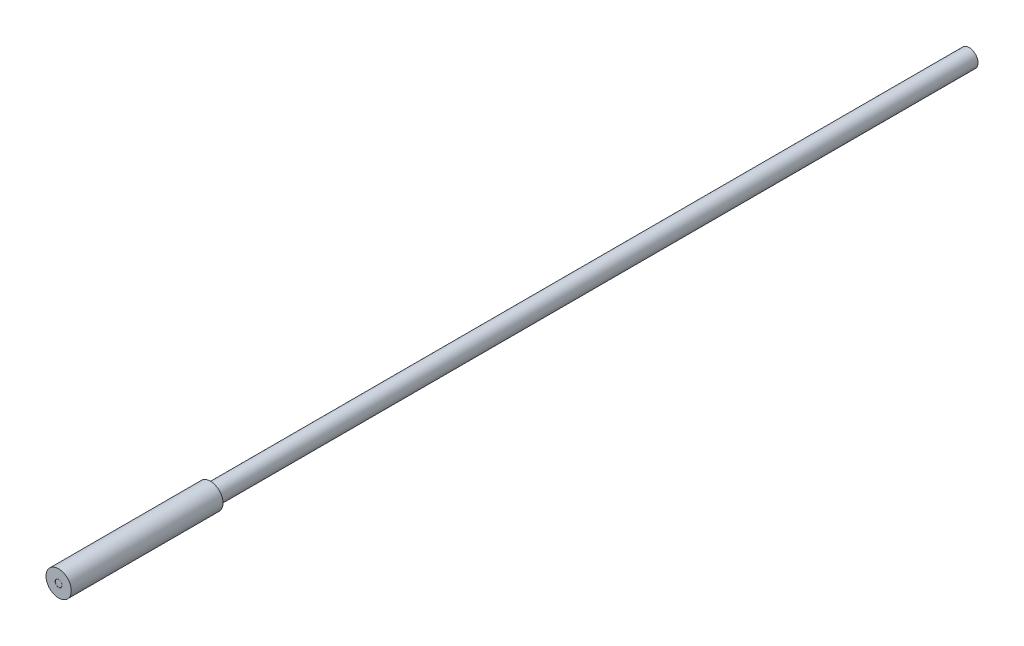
ISO-10303-21;
HEADER;
FILE_DESCRIPTION(('STEP AP214'),'2;1');
FILE_NAME('part.step','',(''),(''),'','','');
FILE_SCHEMA(('AUTOMOTIVE_DESIGN { 1 0 10303 214 1 1 1 1 }'));
ENDSEC;
DATA;
#1=APPLICATION_CONTEXT('core data for automotive mechanical design processes');
#2=APPLICATION_PROTOCOL_DEFINITION('international standard','automotive_design',2000,#1);
#3=PRODUCT_CONTEXT('',#1,'mechanical');
#4=PRODUCT('Part','Part','',(#3));
#5=PRODUCT_RELATED_PRODUCT_CATEGORY('part','',(#4));
#6=PRODUCT_DEFINITION_FORMATION('','',#4);
#7=PRODUCT_DEFINITION_CONTEXT('part definition',#1,'design');
#8=PRODUCT_DEFINITION('design','',#6,#7);
#9=PRODUCT_DEFINITION_SHAPE('','',#8);
#10=(LENGTH_UNIT() NAMED_UNIT(*) SI_UNIT(.MILLI.,.METRE.));
#11=(NAMED_UNIT(*) PLANE_ANGLE_UNIT() SI_UNIT($,.RADIAN.));
#12=(NAMED_UNIT(*) SI_UNIT($,.STERADIAN.) SOLID_ANGLE_UNIT());
#13=UNCERTAINTY_MEASURE_WITH_UNIT(LENGTH_MEASURE(1.E-05),#10,'distance_accuracy_value','');
#14=(GEOMETRIC_REPRESENTATION_CONTEXT(3) GLOBAL_UNCERTAINTY_ASSIGNED_CONTEXT((#13)) GLOBAL_UNIT_ASSIGNED_CONTEXT((#10,
#11,#12)) REPRESENTATION_CONTEXT('',''));
#15=CARTESIAN_POINT('',(0.,0.,0.));
#16=DIRECTION('',(0.,0.,1.));
#17=DIRECTION('',(1.,0.,0.));
#18=AXIS2_PLACEMENT_3D('',#15,#16,#17);
#19=CARTESIAN_POINT('',(0.,0.,-6.));
#20=DIRECTION('',(0.,0.,1.));
#21=DIRECTION('',(1.,0.,0.));
#22=AXIS2_PLACEMENT_3D('',#19,#20,#21);
#23=CYLINDRICAL_SURFACE('',#22,0.5);
#24=CARTESIAN_POINT('',(0.,0.,-6.));
#25=DIRECTION('',(0.,0.,1.));
#26=DIRECTION('',(1.,0.,0.));
#27=AXIS2_PLACEMENT_3D('',#24,#25,#26);
#28=CIRCLE('',#27,0.5);
#29=CARTESIAN_POINT('',(0.5,0.,-6.));
#30=VERTEX_POINT('',#29);
#31=EDGE_CURVE('E41',#30,#30,#28,.T.);
#32=ORIENTED_EDGE('',*,*,#31,.T.);
#33=EDGE_LOOP('',(#32));
#34=FACE_BOUND('',#33,.T.);
#35=CARTESIAN_POINT('',(0.,0.,0.));
#36=DIRECTION('',(0.,0.,1.));
#37=DIRECTION('',(1.,0.,0.));
#38=AXIS2_PLACEMENT_3D('',#35,#36,#37);
#39=CIRCLE('',#38,0.5);
#40=CARTESIAN_POINT('',(0.5,0.,0.));
#41=VERTEX_POINT('',#40);
#42=EDGE_CURVE('E37',#41,#41,#39,.T.);
#43=ORIENTED_EDGE('',*,*,#42,.F.);
#44=EDGE_LOOP('',(#43));
#45=FACE_BOUND('',#44,.T.);
#46=ADVANCED_FACE('F34',(#34,#45),#23,.T.);
#47=CARTESIAN_POINT('',(0.,0.,-6.));
#48=DIRECTION('',(0.,0.,1.));
#49=DIRECTION('',(1.,0.,0.));
#50=AXIS2_PLACEMENT_3D('',#47,#48,#49);
#51=PLANE('',#50);
#52=CARTESIAN_POINT('',(0.,0.,-6.));
#53=DIRECTION('',(0.,0.,-1.));
#54=DIRECTION('',(-1.,0.,0.));
#55=AXIS2_PLACEMENT_3D('',#52,#53,#54);
#56=CIRCLE('',#55,0.35);
#57=CARTESIAN_POINT('',(-0.35,0.,-6.));
#58=VERTEX_POINT('',#57);
#59=EDGE_CURVE('E10',#58,#58,#56,.T.);
#60=ORIENTED_EDGE('',*,*,#59,.F.);
#61=EDGE_LOOP('',(#60));
#62=FACE_BOUND('',#61,.T.);
#63=ORIENTED_EDGE('',*,*,#31,.F.);
#64=EDGE_LOOP('',(#63));
#65=FACE_BOUND('',#64,.T.);
#66=ADVANCED_FACE('F83',(#62,#65),#51,.F.);
#67=CARTESIAN_POINT('',(0.,0.,0.));
#68=DIRECTION('',(0.,0.,1.));
#69=DIRECTION('',(1.,0.,0.));
#70=AXIS2_PLACEMENT_3D('',#67,#68,#69);
#71=PLANE('',#70);
#72=CARTESIAN_POINT('',(0.,0.,0.));
#73=DIRECTION('',(0.,0.,1.));
#74=DIRECTION('',(1.,0.,0.));
#75=AXIS2_PLACEMENT_3D('',#72,#73,#74);
#76=CIRCLE('',#75,0.1375);
#77=CARTESIAN_POINT('',(0.1375,0.,0.));
#78=VERTEX_POINT('',#77);
#79=EDGE_CURVE('E51',#78,#78,#76,.T.);
#80=ORIENTED_EDGE('',*,*,#79,.F.);
#81=EDGE_LOOP('',(#80));
#82=FACE_BOUND('',#81,.T.);
#83=ORIENTED_EDGE('',*,*,#42,.T.);
#84=EDGE_LOOP('',(#83));
#85=FACE_BOUND('',#84,.T.);
#86=ADVANCED_FACE('F79',(#82,#85),#71,.T.);
#87=CARTESIAN_POINT('',(0.,0.,-36.));
#88=DIRECTION('',(0.,0.,1.));
#89=DIRECTION('',(1.,0.,0.));
#90=AXIS2_PLACEMENT_3D('',#87,#88,#89);
#91=CYLINDRICAL_SURFACE('',#90,0.35);
#92=CARTESIAN_POINT('',(0.,0.,-36.));
#93=DIRECTION('',(0.,0.,-1.));
#94=DIRECTION('',(-1.,0.,0.));
#95=AXIS2_PLACEMENT_3D('',#92,#93,#94);
#96=CIRCLE('',#95,0.35);
#97=CARTESIAN_POINT('',(-0.35,0.,-36.));
#98=VERTEX_POINT('',#97);
#99=EDGE_CURVE('E47',#98,#98,#96,.T.);
#100=ORIENTED_EDGE('',*,*,#99,.F.);
#101=EDGE_LOOP('',(#100));
#102=FACE_BOUND('',#101,.T.);
#103=ORIENTED_EDGE('',*,*,#59,.T.);
#104=EDGE_LOOP('',(#103));
#105=FACE_BOUND('',#104,.T.);
#106=ADVANCED_FACE('F82',(#102,#105),#91,.T.);
#107=CARTESIAN_POINT('',(0.,0.,-36.));
#108=DIRECTION('',(0.,0.,-1.));
#109=DIRECTION('',(-1.,0.,0.));
#110=AXIS2_PLACEMENT_3D('',#107,#108,#109);
#111=PLANE('',#110);
#112=ORIENTED_EDGE('',*,*,#99,.T.);
#113=EDGE_LOOP('',(#112));
#114=FACE_BOUND('',#113,.T.);
#115=ADVANCED_FACE('F75',(#114),#111,.T.);
#116=CARTESIAN_POINT('',(0.,0.,-0.1));
#117=DIRECTION('',(0.,0.,1.));
#118=DIRECTION('',(1.,0.,0.));
#119=AXIS2_PLACEMENT_3D('',#116,#117,#118);
#120=CYLINDRICAL_SURFACE('',#119,0.1375);
#121=CARTESIAN_POINT('',(0.,0.,-0.1));
#122=DIRECTION('',(0.,0.,1.));
#123=DIRECTION('',(1.,0.,0.));
#124=AXIS2_PLACEMENT_3D('',#121,#122,#123);
#125=CIRCLE('',#124,0.1375);
#126=CARTESIAN_POINT('',(0.1375,0.,-0.1));
#127=VERTEX_POINT('',#126);
#128=EDGE_CURVE('E50',#127,#127,#125,.T.);
#129=ORIENTED_EDGE('',*,*,#128,.F.);
#130=EDGE_LOOP('',(#129));
#131=FACE_BOUND('',#130,.T.);
#132=ORIENTED_EDGE('',*,*,#79,.T.);
#133=EDGE_LOOP('',(#132));
#134=FACE_BOUND('',#133,.T.);
#135=ADVANCED_FACE('F69',(#131,#134),#120,.F.);
#136=CARTESIAN_POINT('',(0.,0.,-0.1));
#137=DIRECTION('',(0.,0.,1.));
#138=DIRECTION('',(1.,0.,0.));
#139=AXIS2_PLACEMENT_3D('',#136,#137,#138);
#140=PLANE('',#139);
#141=CARTESIAN_POINT('',(0.,0.,-0.1));
#142=DIRECTION('',(0.,0.,1.));
#143=DIRECTION('',(1.,0.,0.));
#144=AXIS2_PLACEMENT_3D('',#141,#142,#143);
#145=CIRCLE('',#144,0.1325);
#146=CARTESIAN_POINT('',(0.1325,0.,-0.1));
#147=VERTEX_POINT('',#146);
#148=EDGE_CURVE('E54',#147,#147,#145,.T.);
#149=ORIENTED_EDGE('',*,*,#148,.F.);
#150=EDGE_LOOP('',(#149));
#151=FACE_BOUND('',#150,.T.);
#152=ORIENTED_EDGE('',*,*,#128,.T.);
#153=EDGE_LOOP('',(#152));
#154=FACE_BOUND('',#153,.T.);
#155=ADVANCED_FACE('F66',(#151,#154),#140,.T.);
#156=CARTESIAN_POINT('',(0.,0.,-0.1));
#157=DIRECTION('',(0.,0.,1.));
#158=DIRECTION('',(1.,0.,0.));
#159=AXIS2_PLACEMENT_3D('',#156,#157,#158);
#160=CYLINDRICAL_SURFACE('',#159,0.1325);
#161=ORIENTED_EDGE('',*,*,#148,.T.);
#162=EDGE_LOOP('',(#161));
#163=FACE_BOUND('',#162,.T.);
#164=CARTESIAN_POINT('',(0.,0.,0.));
#165=DIRECTION('',(0.,0.,1.));
#166=DIRECTION('',(1.,0.,0.));
#167=AXIS2_PLACEMENT_3D('',#164,#165,#166);
#168=CIRCLE('',#167,0.1325);
#169=CARTESIAN_POINT('',(0.1325,0.,0.));
#170=VERTEX_POINT('',#169);
#171=EDGE_CURVE('E57',#170,#170,#168,.T.);
#172=ORIENTED_EDGE('',*,*,#171,.F.);
#173=EDGE_LOOP('',(#172));
#174=FACE_BOUND('',#173,.T.);
#175=ADVANCED_FACE('F63',(#163,#174),#160,.T.);
#176=ORIENTED_EDGE('',*,*,#171,.T.);
#177=EDGE_LOOP('',(#176));
#178=FACE_BOUND('',#177,.T.);
#179=ADVANCED_FACE('F84',(#178),#71,.T.);
#180=CLOSED_SHELL('',(#46,#66,#86,#106,#115,#135,#155,#175,#179));
#181=MANIFOLD_SOLID_BREP('B2',#180);
#182=ADVANCED_BREP_SHAPE_REPRESENTATION('',(#18,#181),#14);
#183=SHAPE_DEFINITION_REPRESENTATION(#9,#182);
ENDSEC;
END-ISO-10303-21;
